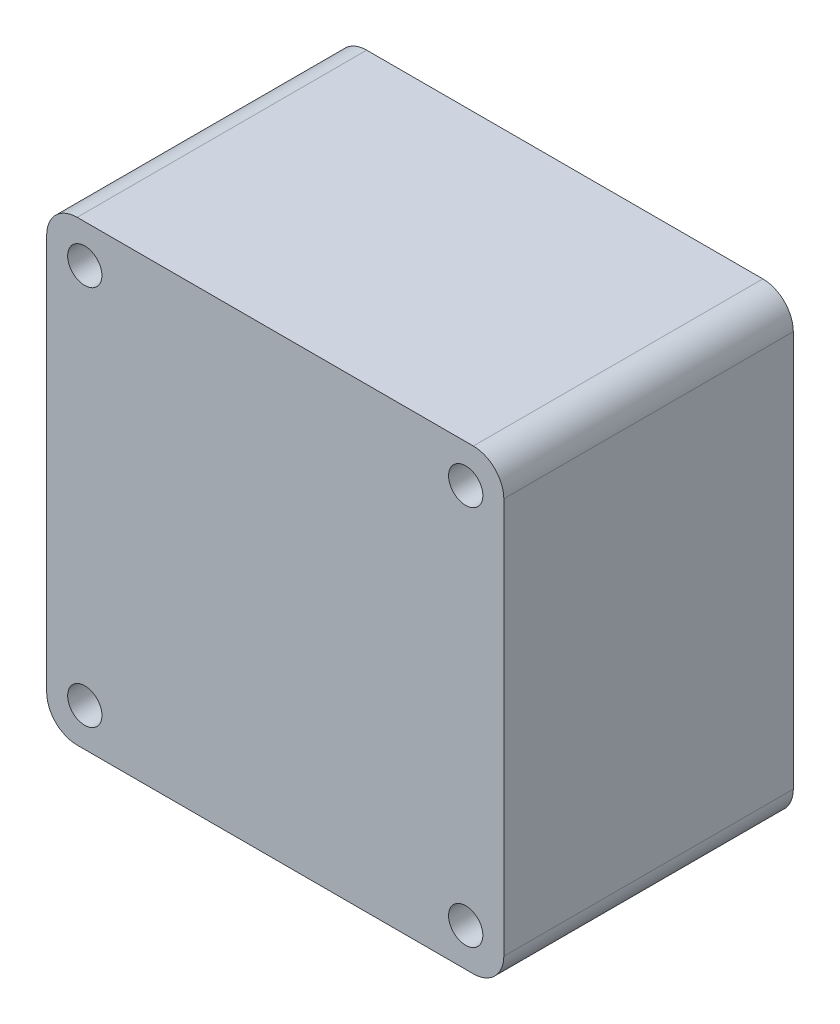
ISO-10303-21;
HEADER;
FILE_DESCRIPTION(('STEP AP214'),'2;1');
FILE_NAME('part.step','',(''),(''),'','','');
FILE_SCHEMA(('AUTOMOTIVE_DESIGN { 1 0 10303 214 1 1 1 1 }'));
ENDSEC;
DATA;
#1=APPLICATION_CONTEXT('core data for automotive mechanical design processes');
#2=APPLICATION_PROTOCOL_DEFINITION('international standard','automotive_design',2000,#1);
#3=PRODUCT_CONTEXT('',#1,'mechanical');
#4=PRODUCT('Part','Part','',(#3));
#5=PRODUCT_RELATED_PRODUCT_CATEGORY('part','',(#4));
#6=PRODUCT_DEFINITION_FORMATION('','',#4);
#7=PRODUCT_DEFINITION_CONTEXT('part definition',#1,'design');
#8=PRODUCT_DEFINITION('design','',#6,#7);
#9=PRODUCT_DEFINITION_SHAPE('','',#8);
#10=(LENGTH_UNIT() NAMED_UNIT(*) SI_UNIT(.MILLI.,.METRE.));
#11=(NAMED_UNIT(*) PLANE_ANGLE_UNIT() SI_UNIT($,.RADIAN.));
#12=(NAMED_UNIT(*) SI_UNIT($,.STERADIAN.) SOLID_ANGLE_UNIT());
#13=UNCERTAINTY_MEASURE_WITH_UNIT(LENGTH_MEASURE(1.E-05),#10,'distance_accuracy_value','');
#14=(GEOMETRIC_REPRESENTATION_CONTEXT(3) GLOBAL_UNCERTAINTY_ASSIGNED_CONTEXT((#13)) GLOBAL_UNIT_ASSIGNED_CONTEXT((#10,
#11,#12)) REPRESENTATION_CONTEXT('',''));
#15=CARTESIAN_POINT('',(0.,0.,0.));
#16=DIRECTION('',(0.,0.,1.));
#17=DIRECTION('',(1.,0.,0.));
#18=AXIS2_PLACEMENT_3D('',#15,#16,#17);
#19=CARTESIAN_POINT('',(-620.046234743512,0.,-122.852813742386));
#20=DIRECTION('',(1.,0.,0.));
#21=DIRECTION('',(0.,0.,-1.));
#22=AXIS2_PLACEMENT_3D('',#19,#20,#21);
#23=PLANE('',#22);
#24=DIRECTION('',(0.,-1.,0.));
#25=VECTOR('',#24,1.);
#26=CARTESIAN_POINT('',(-620.046234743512,0.,-38.));
#27=LINE('',#26,#25);
#28=CARTESIAN_POINT('',(-620.046234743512,895.953843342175,-38.));
#29=VERTEX_POINT('',#28);
#30=CARTESIAN_POINT('',(-620.046234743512,843.953843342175,-38.));
#31=VERTEX_POINT('',#30);
#32=EDGE_CURVE('E97',#29,#31,#27,.T.);
#33=ORIENTED_EDGE('',*,*,#32,.F.);
#34=DIRECTION('',(0.,0.,1.));
#35=VECTOR('',#34,1.);
#36=CARTESIAN_POINT('',(-620.046234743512,895.953843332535,-122.852813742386));
#37=LINE('',#36,#35);
#38=CARTESIAN_POINT('',(-620.046234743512,895.953843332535,0.));
#39=VERTEX_POINT('',#38);
#40=EDGE_CURVE('E147',#29,#39,#37,.T.);
#41=ORIENTED_EDGE('',*,*,#40,.T.);
#42=DIRECTION('',(0.,1.,0.));
#43=VECTOR('',#42,1.);
#44=CARTESIAN_POINT('',(-620.046234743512,0.,0.));
#45=LINE('',#44,#43);
#46=CARTESIAN_POINT('',(-620.046234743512,843.953843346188,0.));
#47=VERTEX_POINT('',#46);
#48=EDGE_CURVE('E145',#47,#39,#45,.T.);
#49=ORIENTED_EDGE('',*,*,#48,.F.);
#50=DIRECTION('',(0.,0.,1.));
#51=VECTOR('',#50,1.);
#52=CARTESIAN_POINT('',(-620.046234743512,843.953843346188,-122.852813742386));
#53=LINE('',#52,#51);
#54=EDGE_CURVE('E151',#31,#47,#53,.T.);
#55=ORIENTED_EDGE('',*,*,#54,.F.);
#56=EDGE_LOOP('',(#33,#41,#49,#55));
#57=FACE_BOUND('',#56,.T.);
#58=ADVANCED_FACE('F45',(#57),#23,.T.);
#59=CARTESIAN_POINT('',(-624.046234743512,843.953843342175,-122.852813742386));
#60=DIRECTION('',(0.,0.,1.));
#61=DIRECTION('',(1.,0.,0.));
#62=AXIS2_PLACEMENT_3D('',#59,#60,#61);
#63=CYLINDRICAL_SURFACE('',#62,4.);
#64=CARTESIAN_POINT('',(-624.046234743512,843.953843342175,-38.));
#65=DIRECTION('',(0.,0.,1.));
#66=DIRECTION('',(1.,0.,0.));
#67=AXIS2_PLACEMENT_3D('',#64,#65,#66);
#68=CIRCLE('',#67,4.);
#69=CARTESIAN_POINT('',(-624.046234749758,839.953843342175,-38.));
#70=VERTEX_POINT('',#69);
#71=EDGE_CURVE('E154',#31,#70,#68,.F.);
#72=ORIENTED_EDGE('',*,*,#71,.F.);
#73=ORIENTED_EDGE('',*,*,#54,.T.);
#74=CARTESIAN_POINT('',(-624.046234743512,843.953843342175,0.));
#75=DIRECTION('',(0.,0.,1.));
#76=DIRECTION('',(1.,0.,0.));
#77=AXIS2_PLACEMENT_3D('',#74,#75,#76);
#78=CIRCLE('',#77,4.);
#79=CARTESIAN_POINT('',(-624.046234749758,839.953843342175,0.));
#80=VERTEX_POINT('',#79);
#81=EDGE_CURVE('E155',#80,#47,#78,.T.);
#82=ORIENTED_EDGE('',*,*,#81,.F.);
#83=DIRECTION('',(0.,0.,1.));
#84=VECTOR('',#83,1.);
#85=CARTESIAN_POINT('',(-624.046234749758,839.953843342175,-122.852813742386));
#86=LINE('',#85,#84);
#87=EDGE_CURVE('E170',#70,#80,#86,.T.);
#88=ORIENTED_EDGE('',*,*,#87,.F.);
#89=EDGE_LOOP('',(#72,#73,#82,#88));
#90=FACE_BOUND('',#89,.T.);
#91=ADVANCED_FACE('F261',(#90),#63,.T.);
#92=CARTESIAN_POINT('',(0.,839.953843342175,-122.852813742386));
#93=DIRECTION('',(0.,-1.,0.));
#94=DIRECTION('',(0.,0.,-1.));
#95=AXIS2_PLACEMENT_3D('',#92,#93,#94);
#96=PLANE('',#95);
#97=DIRECTION('',(-1.,0.,0.));
#98=VECTOR('',#97,1.);
#99=CARTESIAN_POINT('',(0.,839.953843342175,-38.));
#100=LINE('',#99,#98);
#101=CARTESIAN_POINT('',(-676.046234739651,839.953843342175,-38.));
#102=VERTEX_POINT('',#101);
#103=EDGE_CURVE('E158',#70,#102,#100,.T.);
#104=ORIENTED_EDGE('',*,*,#103,.F.);
#105=ORIENTED_EDGE('',*,*,#87,.T.);
#106=DIRECTION('',(1.,0.,0.));
#107=VECTOR('',#106,1.);
#108=CARTESIAN_POINT('',(0.,839.953843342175,0.));
#109=LINE('',#108,#107);
#110=CARTESIAN_POINT('',(-676.046234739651,839.953843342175,0.));
#111=VERTEX_POINT('',#110);
#112=EDGE_CURVE('E190',#111,#80,#109,.T.);
#113=ORIENTED_EDGE('',*,*,#112,.F.);
#114=DIRECTION('',(0.,0.,1.));
#115=VECTOR('',#114,1.);
#116=CARTESIAN_POINT('',(-676.046234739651,839.953843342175,-122.852813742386));
#117=LINE('',#116,#115);
#118=EDGE_CURVE('E172',#102,#111,#117,.T.);
#119=ORIENTED_EDGE('',*,*,#118,.F.);
#120=EDGE_LOOP('',(#104,#105,#113,#119));
#121=FACE_BOUND('',#120,.T.);
#122=ADVANCED_FACE('F264',(#121),#96,.T.);
#123=CARTESIAN_POINT('',(-676.046234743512,843.953843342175,-122.852813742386));
#124=DIRECTION('',(0.,0.,1.));
#125=DIRECTION('',(1.,0.,0.));
#126=AXIS2_PLACEMENT_3D('',#123,#124,#125);
#127=CYLINDRICAL_SURFACE('',#126,4.);
#128=CARTESIAN_POINT('',(-676.046234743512,843.953843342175,-38.));
#129=DIRECTION('',(0.,0.,1.));
#130=DIRECTION('',(1.,0.,0.));
#131=AXIS2_PLACEMENT_3D('',#128,#129,#130);
#132=CIRCLE('',#131,4.);
#133=CARTESIAN_POINT('',(-680.046234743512,843.953843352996,-38.));
#134=VERTEX_POINT('',#133);
#135=EDGE_CURVE('E161',#102,#134,#132,.F.);
#136=ORIENTED_EDGE('',*,*,#135,.F.);
#137=ORIENTED_EDGE('',*,*,#118,.T.);
#138=CARTESIAN_POINT('',(-676.046234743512,843.953843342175,0.));
#139=DIRECTION('',(0.,0.,1.));
#140=DIRECTION('',(1.,0.,0.));
#141=AXIS2_PLACEMENT_3D('',#138,#139,#140);
#142=CIRCLE('',#141,4.);
#143=CARTESIAN_POINT('',(-680.046234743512,843.953843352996,0.));
#144=VERTEX_POINT('',#143);
#145=EDGE_CURVE('E187',#144,#111,#142,.T.);
#146=ORIENTED_EDGE('',*,*,#145,.F.);
#147=DIRECTION('',(0.,0.,1.));
#148=VECTOR('',#147,1.);
#149=CARTESIAN_POINT('',(-680.046234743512,843.953843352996,-122.852813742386));
#150=LINE('',#149,#148);
#151=EDGE_CURVE('E139',#134,#144,#150,.T.);
#152=ORIENTED_EDGE('',*,*,#151,.F.);
#153=EDGE_LOOP('',(#136,#137,#146,#152));
#154=FACE_BOUND('',#153,.T.);
#155=ADVANCED_FACE('F270',(#154),#127,.T.);
#156=CARTESIAN_POINT('',(-680.046234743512,0.,-122.852813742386));
#157=DIRECTION('',(-1.,0.,0.));
#158=DIRECTION('',(0.,0.,1.));
#159=AXIS2_PLACEMENT_3D('',#156,#157,#158);
#160=PLANE('',#159);
#161=DIRECTION('',(0.,1.,0.));
#162=VECTOR('',#161,1.);
#163=CARTESIAN_POINT('',(-680.046234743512,0.,-38.));
#164=LINE('',#163,#162);
#165=CARTESIAN_POINT('',(-680.046234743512,895.953843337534,-38.));
#166=VERTEX_POINT('',#165);
#167=EDGE_CURVE('E110',#134,#166,#164,.T.);
#168=ORIENTED_EDGE('',*,*,#167,.F.);
#169=ORIENTED_EDGE('',*,*,#151,.T.);
#170=DIRECTION('',(0.,-1.,0.));
#171=VECTOR('',#170,1.);
#172=CARTESIAN_POINT('',(-680.046234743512,0.,0.));
#173=LINE('',#172,#171);
#174=CARTESIAN_POINT('',(-680.046234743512,895.953843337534,0.));
#175=VERTEX_POINT('',#174);
#176=EDGE_CURVE('E191',#175,#144,#173,.T.);
#177=ORIENTED_EDGE('',*,*,#176,.F.);
#178=DIRECTION('',(0.,0.,1.));
#179=VECTOR('',#178,1.);
#180=CARTESIAN_POINT('',(-680.046234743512,895.953843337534,-122.852813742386));
#181=LINE('',#180,#179);
#182=EDGE_CURVE('E130',#166,#175,#181,.T.);
#183=ORIENTED_EDGE('',*,*,#182,.F.);
#184=EDGE_LOOP('',(#168,#169,#177,#183));
#185=FACE_BOUND('',#184,.T.);
#186=ADVANCED_FACE('F274',(#185),#160,.T.);
#187=CARTESIAN_POINT('',(-676.046234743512,895.953843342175,-122.852813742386));
#188=DIRECTION('',(0.,0.,1.));
#189=DIRECTION('',(1.,0.,0.));
#190=AXIS2_PLACEMENT_3D('',#187,#188,#189);
#191=CYLINDRICAL_SURFACE('',#190,4.);
#192=CARTESIAN_POINT('',(-676.046234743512,895.953843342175,-38.));
#193=DIRECTION('',(0.,0.,1.));
#194=DIRECTION('',(1.,0.,0.));
#195=AXIS2_PLACEMENT_3D('',#192,#193,#194);
#196=CIRCLE('',#195,4.);
#197=CARTESIAN_POINT('',(-676.046234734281,899.953843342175,-38.));
#198=VERTEX_POINT('',#197);
#199=EDGE_CURVE('E112',#166,#198,#196,.F.);
#200=ORIENTED_EDGE('',*,*,#199,.F.);
#201=ORIENTED_EDGE('',*,*,#182,.T.);
#202=CARTESIAN_POINT('',(-676.046234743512,895.953843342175,0.));
#203=DIRECTION('',(0.,0.,1.));
#204=DIRECTION('',(1.,0.,0.));
#205=AXIS2_PLACEMENT_3D('',#202,#203,#204);
#206=CIRCLE('',#205,4.);
#207=CARTESIAN_POINT('',(-676.046234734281,899.953843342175,0.));
#208=VERTEX_POINT('',#207);
#209=EDGE_CURVE('E126',#208,#175,#206,.T.);
#210=ORIENTED_EDGE('',*,*,#209,.F.);
#211=DIRECTION('',(0.,0.,1.));
#212=VECTOR('',#211,1.);
#213=CARTESIAN_POINT('',(-676.046234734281,899.953843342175,-122.852813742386));
#214=LINE('',#213,#212);
#215=EDGE_CURVE('E121',#198,#208,#214,.T.);
#216=ORIENTED_EDGE('',*,*,#215,.F.);
#217=EDGE_LOOP('',(#200,#201,#210,#216));
#218=FACE_BOUND('',#217,.T.);
#219=ADVANCED_FACE('F124',(#218),#191,.T.);
#220=CARTESIAN_POINT('',(0.,899.953843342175,-122.852813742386));
#221=DIRECTION('',(0.,1.,0.));
#222=DIRECTION('',(0.,0.,1.));
#223=AXIS2_PLACEMENT_3D('',#220,#221,#222);
#224=PLANE('',#223);
#225=DIRECTION('',(1.,0.,0.));
#226=VECTOR('',#225,1.);
#227=CARTESIAN_POINT('',(0.,899.953843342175,-38.));
#228=LINE('',#227,#226);
#229=CARTESIAN_POINT('',(-624.046234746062,899.953843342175,-38.));
#230=VERTEX_POINT('',#229);
#231=EDGE_CURVE('E49',#198,#230,#228,.T.);
#232=ORIENTED_EDGE('',*,*,#231,.F.);
#233=ORIENTED_EDGE('',*,*,#215,.T.);
#234=DIRECTION('',(-1.,0.,0.));
#235=VECTOR('',#234,1.);
#236=CARTESIAN_POINT('',(0.,899.953843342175,0.));
#237=LINE('',#236,#235);
#238=CARTESIAN_POINT('',(-624.046234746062,899.953843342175,0.));
#239=VERTEX_POINT('',#238);
#240=EDGE_CURVE('E167',#239,#208,#237,.T.);
#241=ORIENTED_EDGE('',*,*,#240,.F.);
#242=DIRECTION('',(0.,0.,1.));
#243=VECTOR('',#242,1.);
#244=CARTESIAN_POINT('',(-624.046234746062,899.953843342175,-122.852813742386));
#245=LINE('',#244,#243);
#246=EDGE_CURVE('E92',#230,#239,#245,.T.);
#247=ORIENTED_EDGE('',*,*,#246,.F.);
#248=EDGE_LOOP('',(#232,#233,#241,#247));
#249=FACE_BOUND('',#248,.T.);
#250=ADVANCED_FACE('F120',(#249),#224,.T.);
#251=CARTESIAN_POINT('',(-675.046234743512,844.953843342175,-122.852813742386));
#252=DIRECTION('',(0.,0.,1.));
#253=DIRECTION('',(1.,0.,0.));
#254=AXIS2_PLACEMENT_3D('',#251,#252,#253);
#255=CYLINDRICAL_SURFACE('',#254,2.24999999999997);
#256=CARTESIAN_POINT('',(-675.046234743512,844.953843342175,-38.));
#257=DIRECTION('',(0.,0.,1.));
#258=DIRECTION('',(1.,0.,0.));
#259=AXIS2_PLACEMENT_3D('',#256,#257,#258);
#260=CIRCLE('',#259,2.24999999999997);
#261=CARTESIAN_POINT('',(-672.796234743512,844.953843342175,-38.));
#262=VERTEX_POINT('',#261);
#263=EDGE_CURVE('E129',#262,#262,#260,.F.);
#264=ORIENTED_EDGE('',*,*,#263,.T.);
#265=EDGE_LOOP('',(#264));
#266=FACE_BOUND('',#265,.T.);
#267=CARTESIAN_POINT('',(-675.046234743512,844.953843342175,0.));
#268=DIRECTION('',(0.,0.,1.));
#269=DIRECTION('',(1.,0.,0.));
#270=AXIS2_PLACEMENT_3D('',#267,#268,#269);
#271=CIRCLE('',#270,2.24999999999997);
#272=CARTESIAN_POINT('',(-672.796234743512,844.953843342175,0.));
#273=VERTEX_POINT('',#272);
#274=EDGE_CURVE('E136',#273,#273,#271,.T.);
#275=ORIENTED_EDGE('',*,*,#274,.T.);
#276=EDGE_LOOP('',(#275));
#277=FACE_BOUND('',#276,.T.);
#278=ADVANCED_FACE('F281',(#266,#277),#255,.F.);
#279=CARTESIAN_POINT('',(-625.046234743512,844.953843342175,-122.852813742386));
#280=DIRECTION('',(0.,0.,1.));
#281=DIRECTION('',(1.,0.,0.));
#282=AXIS2_PLACEMENT_3D('',#279,#280,#281);
#283=CYLINDRICAL_SURFACE('',#282,2.24999999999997);
#284=CARTESIAN_POINT('',(-625.046234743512,844.953843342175,-38.));
#285=DIRECTION('',(0.,0.,1.));
#286=DIRECTION('',(1.,0.,0.));
#287=AXIS2_PLACEMENT_3D('',#284,#285,#286);
#288=CIRCLE('',#287,2.24999999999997);
#289=CARTESIAN_POINT('',(-622.796234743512,844.953843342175,-38.));
#290=VERTEX_POINT('',#289);
#291=EDGE_CURVE('E177',#290,#290,#288,.F.);
#292=ORIENTED_EDGE('',*,*,#291,.T.);
#293=EDGE_LOOP('',(#292));
#294=FACE_BOUND('',#293,.T.);
#295=CARTESIAN_POINT('',(-625.046234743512,844.953843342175,0.));
#296=DIRECTION('',(0.,0.,1.));
#297=DIRECTION('',(1.,0.,0.));
#298=AXIS2_PLACEMENT_3D('',#295,#296,#297);
#299=CIRCLE('',#298,2.24999999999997);
#300=CARTESIAN_POINT('',(-622.796234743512,844.953843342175,0.));
#301=VERTEX_POINT('',#300);
#302=EDGE_CURVE('E174',#301,#301,#299,.T.);
#303=ORIENTED_EDGE('',*,*,#302,.T.);
#304=EDGE_LOOP('',(#303));
#305=FACE_BOUND('',#304,.T.);
#306=ADVANCED_FACE('F226',(#294,#305),#283,.F.);
#307=CARTESIAN_POINT('',(-625.046234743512,894.953843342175,-122.852813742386));
#308=DIRECTION('',(0.,0.,1.));
#309=DIRECTION('',(1.,0.,0.));
#310=AXIS2_PLACEMENT_3D('',#307,#308,#309);
#311=CYLINDRICAL_SURFACE('',#310,2.24999999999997);
#312=CARTESIAN_POINT('',(-625.046234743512,894.953843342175,-38.));
#313=DIRECTION('',(0.,0.,1.));
#314=DIRECTION('',(1.,0.,0.));
#315=AXIS2_PLACEMENT_3D('',#312,#313,#314);
#316=CIRCLE('',#315,2.24999999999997);
#317=CARTESIAN_POINT('',(-622.796234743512,894.953843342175,-38.));
#318=VERTEX_POINT('',#317);
#319=EDGE_CURVE('E176',#318,#318,#316,.F.);
#320=ORIENTED_EDGE('',*,*,#319,.T.);
#321=EDGE_LOOP('',(#320));
#322=FACE_BOUND('',#321,.T.);
#323=CARTESIAN_POINT('',(-625.046234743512,894.953843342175,0.));
#324=DIRECTION('',(0.,0.,1.));
#325=DIRECTION('',(1.,0.,0.));
#326=AXIS2_PLACEMENT_3D('',#323,#324,#325);
#327=CIRCLE('',#326,2.24999999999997);
#328=CARTESIAN_POINT('',(-622.796234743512,894.953843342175,0.));
#329=VERTEX_POINT('',#328);
#330=EDGE_CURVE('E182',#329,#329,#327,.T.);
#331=ORIENTED_EDGE('',*,*,#330,.T.);
#332=EDGE_LOOP('',(#331));
#333=FACE_BOUND('',#332,.T.);
#334=ADVANCED_FACE('F238',(#322,#333),#311,.F.);
#335=CARTESIAN_POINT('',(-675.046234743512,894.953843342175,-122.852813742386));
#336=DIRECTION('',(0.,0.,1.));
#337=DIRECTION('',(1.,0.,0.));
#338=AXIS2_PLACEMENT_3D('',#335,#336,#337);
#339=CYLINDRICAL_SURFACE('',#338,2.24999999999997);
#340=CARTESIAN_POINT('',(-675.046234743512,894.953843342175,-38.));
#341=DIRECTION('',(0.,0.,1.));
#342=DIRECTION('',(1.,0.,0.));
#343=AXIS2_PLACEMENT_3D('',#340,#341,#342);
#344=CIRCLE('',#343,2.24999999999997);
#345=CARTESIAN_POINT('',(-672.796234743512,894.953843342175,-38.));
#346=VERTEX_POINT('',#345);
#347=EDGE_CURVE('E185',#346,#346,#344,.F.);
#348=ORIENTED_EDGE('',*,*,#347,.T.);
#349=EDGE_LOOP('',(#348));
#350=FACE_BOUND('',#349,.T.);
#351=CARTESIAN_POINT('',(-675.046234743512,894.953843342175,0.));
#352=DIRECTION('',(0.,0.,1.));
#353=DIRECTION('',(1.,0.,0.));
#354=AXIS2_PLACEMENT_3D('',#351,#352,#353);
#355=CIRCLE('',#354,2.24999999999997);
#356=CARTESIAN_POINT('',(-672.796234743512,894.953843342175,0.));
#357=VERTEX_POINT('',#356);
#358=EDGE_CURVE('E146',#357,#357,#355,.T.);
#359=ORIENTED_EDGE('',*,*,#358,.T.);
#360=EDGE_LOOP('',(#359));
#361=FACE_BOUND('',#360,.T.);
#362=ADVANCED_FACE('F234',(#350,#361),#339,.F.);
#363=CARTESIAN_POINT('',(-624.046234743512,895.953843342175,-122.852813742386));
#364=DIRECTION('',(0.,0.,1.));
#365=DIRECTION('',(1.,0.,0.));
#366=AXIS2_PLACEMENT_3D('',#363,#364,#365);
#367=CYLINDRICAL_SURFACE('',#366,4.);
#368=CARTESIAN_POINT('',(-624.046234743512,895.953843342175,-38.));
#369=DIRECTION('',(0.,0.,1.));
#370=DIRECTION('',(1.,0.,0.));
#371=AXIS2_PLACEMENT_3D('',#368,#369,#370);
#372=CIRCLE('',#371,4.);
#373=EDGE_CURVE('E11',#230,#29,#372,.F.);
#374=ORIENTED_EDGE('',*,*,#373,.F.);
#375=ORIENTED_EDGE('',*,*,#246,.T.);
#376=CARTESIAN_POINT('',(-624.046234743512,895.953843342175,0.));
#377=DIRECTION('',(0.,0.,1.));
#378=DIRECTION('',(1.,0.,0.));
#379=AXIS2_PLACEMENT_3D('',#376,#377,#378);
#380=CIRCLE('',#379,4.);
#381=EDGE_CURVE('E165',#39,#239,#380,.T.);
#382=ORIENTED_EDGE('',*,*,#381,.F.);
#383=ORIENTED_EDGE('',*,*,#40,.F.);
#384=EDGE_LOOP('',(#374,#375,#382,#383));
#385=FACE_BOUND('',#384,.T.);
#386=ADVANCED_FACE('F237',(#385),#367,.T.);
#387=CARTESIAN_POINT('',(0.,0.,0.));
#388=DIRECTION('',(0.,0.,1.));
#389=DIRECTION('',(1.,0.,0.));
#390=AXIS2_PLACEMENT_3D('',#387,#388,#389);
#391=PLANE('',#390);
#392=ORIENTED_EDGE('',*,*,#358,.F.);
#393=EDGE_LOOP('',(#392));
#394=FACE_BOUND('',#393,.T.);
#395=ORIENTED_EDGE('',*,*,#330,.F.);
#396=EDGE_LOOP('',(#395));
#397=FACE_BOUND('',#396,.T.);
#398=ORIENTED_EDGE('',*,*,#302,.F.);
#399=EDGE_LOOP('',(#398));
#400=FACE_BOUND('',#399,.T.);
#401=ORIENTED_EDGE('',*,*,#274,.F.);
#402=EDGE_LOOP('',(#401));
#403=FACE_BOUND('',#402,.T.);
#404=ORIENTED_EDGE('',*,*,#48,.T.);
#405=ORIENTED_EDGE('',*,*,#381,.T.);
#406=ORIENTED_EDGE('',*,*,#240,.T.);
#407=ORIENTED_EDGE('',*,*,#209,.T.);
#408=ORIENTED_EDGE('',*,*,#176,.T.);
#409=ORIENTED_EDGE('',*,*,#145,.T.);
#410=ORIENTED_EDGE('',*,*,#112,.T.);
#411=ORIENTED_EDGE('',*,*,#81,.T.);
#412=EDGE_LOOP('',(#404,#405,#406,#407,#408,#409,#410,#411));
#413=FACE_BOUND('',#412,.T.);
#414=ADVANCED_FACE('F231',(#394,#397,#400,#403,#413),#391,.T.);
#415=CARTESIAN_POINT('',(-620.046234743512,899.953843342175,-38.));
#416=DIRECTION('',(0.,0.,1.));
#417=DIRECTION('',(0.,1.,0.));
#418=AXIS2_PLACEMENT_3D('',#415,#416,#417);
#419=PLANE('',#418);
#420=ORIENTED_EDGE('',*,*,#291,.F.);
#421=EDGE_LOOP('',(#420));
#422=FACE_BOUND('',#421,.T.);
#423=ORIENTED_EDGE('',*,*,#347,.F.);
#424=EDGE_LOOP('',(#423));
#425=FACE_BOUND('',#424,.T.);
#426=ORIENTED_EDGE('',*,*,#32,.T.);
#427=ORIENTED_EDGE('',*,*,#71,.T.);
#428=ORIENTED_EDGE('',*,*,#103,.T.);
#429=ORIENTED_EDGE('',*,*,#135,.T.);
#430=ORIENTED_EDGE('',*,*,#167,.T.);
#431=ORIENTED_EDGE('',*,*,#199,.T.);
#432=ORIENTED_EDGE('',*,*,#231,.T.);
#433=ORIENTED_EDGE('',*,*,#373,.T.);
#434=EDGE_LOOP('',(#426,#427,#428,#429,#430,#431,#432,#433));
#435=FACE_BOUND('',#434,.T.);
#436=ORIENTED_EDGE('',*,*,#319,.F.);
#437=EDGE_LOOP('',(#436));
#438=FACE_BOUND('',#437,.T.);
#439=ORIENTED_EDGE('',*,*,#263,.F.);
#440=EDGE_LOOP('',(#439));
#441=FACE_BOUND('',#440,.T.);
#442=ADVANCED_FACE('F47',(#422,#425,#435,#438,#441),#419,.F.);
#443=CLOSED_SHELL('',(#58,#91,#122,#155,#186,#219,#250,#278,#306,#334,#362,#386,#414,#442));
#444=MANIFOLD_SOLID_BREP('B2',#443);
#445=ADVANCED_BREP_SHAPE_REPRESENTATION('',(#18,#444),#14);
#446=SHAPE_DEFINITION_REPRESENTATION(#9,#445);
ENDSEC;
END-ISO-10303-21;
